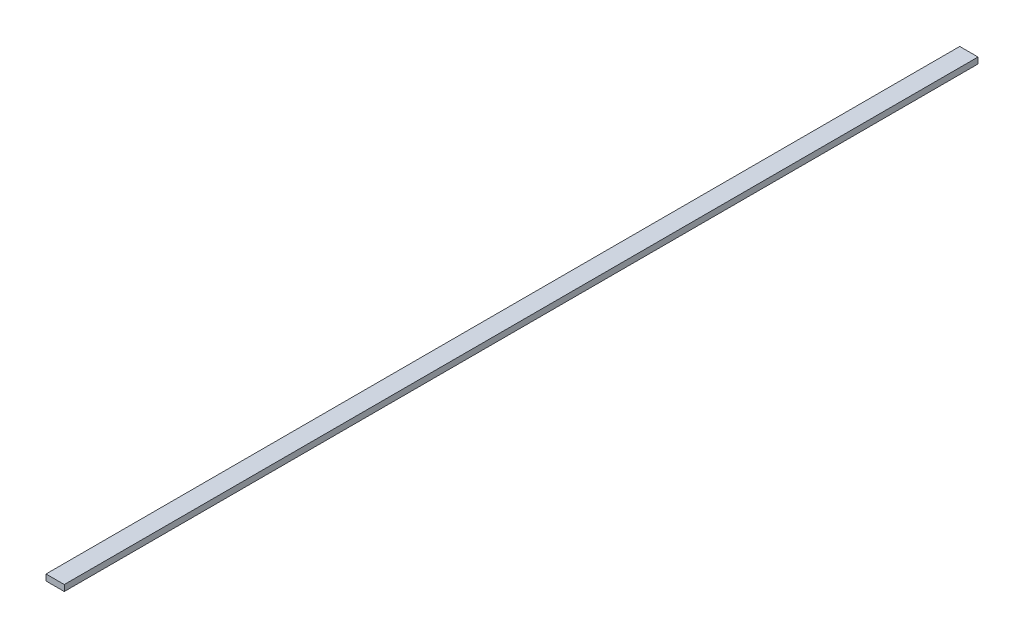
from build123d import *

# Parameters (mm, degrees)
SKETCH1_W           = 9.525
SKETCH1_H           = 3.175
BOSS_EXTRUDE1_DEPTH = 476.25


with BuildPart() as part:
    # Sketch1 → Boss-Extrude1 (new body)
    with BuildSketch(Plane.XY):
        Rectangle(SKETCH1_W, SKETCH1_H)
    extrude(amount=BOSS_EXTRUDE1_DEPTH)


solid = part.part
